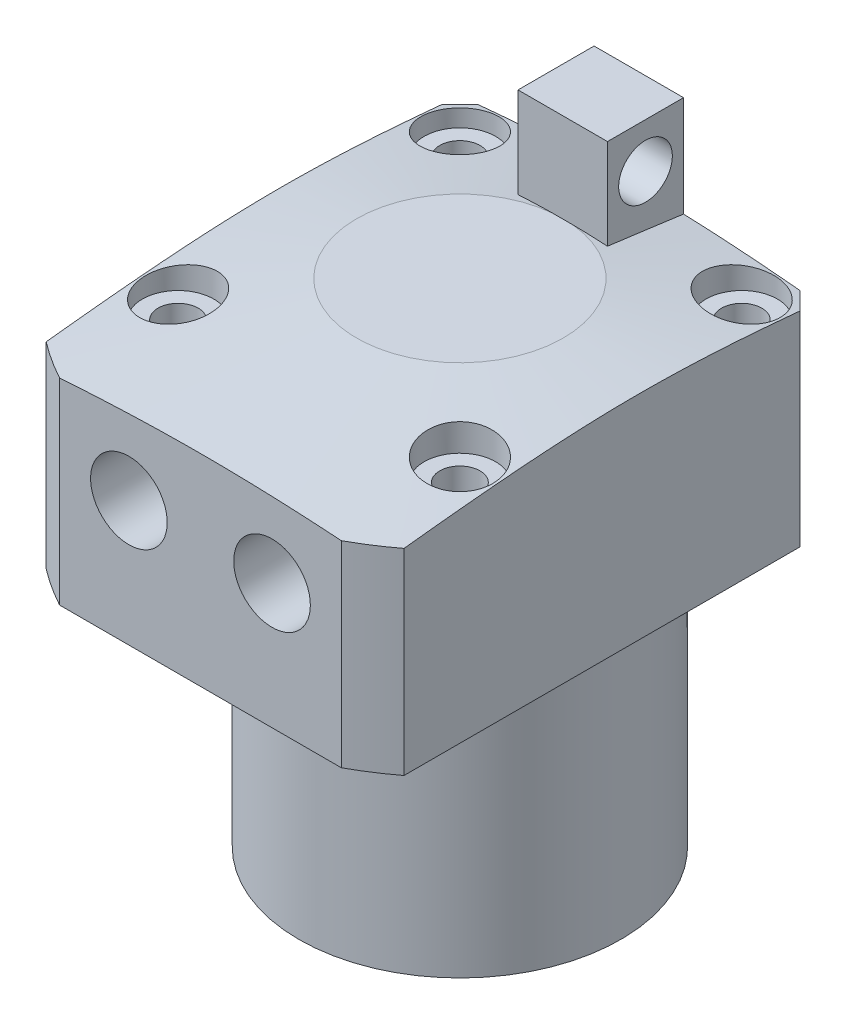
from build123d import *

# Parameters (mm, degrees)
SKETCH2_OUTSIDE_W                            = 89.668
SKETCH2_OUTSIDE_H                            = 89.668
SKETCH2_OUTSIDE_W_2                          = 40
SKETCH2_OUTSIDE_H_2                          = 49
CUT_EXTRUDE2_DEPTH                           = 73.131823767
CHAMFER1_SIZE                                = 2
G1_8_TAPPED_HOLE1_D                          = 8.566
G1_8_TAPPED_HOLE1_DEPTH                      = 22.18
CBORE_FOR_M4_HEX_SOCKET_HEAD_CAP_SCR_2_COUNT = 2
CBORE_FOR_M4_HEX_SOCKET_HEAD_CAP_SCR_2_PITCH = 31.5
CBORE_FOR_M4_HEX_SOCKET_HEAD_CAP_SCR_3_COUNT = 2
CBORE_FOR_M4_HEX_SOCKET_HEAD_CAP_SCR_3_PITCH = 44.547727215
CBORE_FOR_M4_HEX_SOCKET_HEAD_CAP_SCR_4_COUNT = 2
CBORE_FOR_M4_HEX_SOCKET_HEAD_CAP_SCR_4_PITCH = 31.5
F_8_0_8_DIAMETER_HOLE2_D                     = 8
F_8_0_8_DIAMETER_HOLE2_DEPTH                 = 1.5
SKETCH14_W                                   = 10
SKETCH14_H                                   = 8.5
BOSS_EXTRUDE1_DEPTH                          = 10
BOSS_EXTRUDE1_DIRECTION_2_REACH              = 67.315
F_6_0_6_DIAMETER_HOLE1_D                     = 6


with BuildPart() as part:
    # Sketch1 → Revolve1 (revolve)
    with BuildSketch(Plane.XY, mode=Mode.PRIVATE) as revolve1_sk:
        Polygon((0, 0), (-18, 0), (-18, 30), (-33, 30), (-33, 51.986092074), (-11.554930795, 55), (0, 55), align=None)
    revolve(revolve1_sk.sketch.rotate(Axis((0, 87.050829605, 0), (0, -1, 0)), 270), axis=Axis((0, 87.050829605, 0), (0, -1, 0)))

    # Sketch2 outside → Cut-Extrude2 (cut, through all)
    with BuildSketch(Plane(origin=(0, 55, 0), x_dir=(1, 0, 0), z_dir=(0, 1, 0))):
        Rectangle(SKETCH2_OUTSIDE_W, SKETCH2_OUTSIDE_H)
        with Locations((0, -4.5)):
            Rectangle(SKETCH2_OUTSIDE_W_2, SKETCH2_OUTSIDE_H_2, mode=Mode.SUBTRACT)
    extrude(amount=-CUT_EXTRUDE2_DEPTH, mode=Mode.SUBTRACT)

    # Chamfer1
    chamfer1_edges = [part.edges().sort_by_distance(p)[0] for p in [
        (20, 41.324422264, -20),
        (-20, 41.324422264, -20),
    ]]
    chamfer(chamfer1_edges, length=CHAMFER1_SIZE)

    # G1_8 Tapped Hole1
    with Locations(Plane.XY.offset(29)):
        with Locations((-8, 44), (8, 44)):
            Hole(G1_8_TAPPED_HOLE1_D / 2, depth=G1_8_TAPPED_HOLE1_DEPTH)

    # Sketch9 → CBORE for M4 Hex Socket Head Cap Screw2 (revolve, cut)
    with BuildSketch(Plane(origin=(15.75, 55, 15.75), x_dir=(0, 0, 1), z_dir=(1, 0, 0))):
        Polygon((0, 0), (0, 25), (2.275, 25), (2.25, 24.975), (2.25, 4), (4, 4), (4, 0), align=None)
    cbore_for_m4_hex_socket_head_cap_screw2 = revolve(axis=Axis((15.75, 61.35, 15.75), (0, -1, 0)), mode=Mode.SUBTRACT)

    # CBORE for M4 Hex Socket Head Cap Scr 2: CBORE for M4 Hex Socket Head Cap Screw2 ×2
    with Locations(*[(-i * CBORE_FOR_M4_HEX_SOCKET_HEAD_CAP_SCR_2_PITCH, 0, 0) for i in range(1, CBORE_FOR_M4_HEX_SOCKET_HEAD_CAP_SCR_2_COUNT)]):
        add(cbore_for_m4_hex_socket_head_cap_screw2, mode=Mode.SUBTRACT)

    # CBORE for M4 Hex Socket Head Cap Scr 3: CBORE for M4 Hex Socket Head Cap Screw2 ×2
    with Locations(*[Vector(-0.7071067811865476, 0, -0.7071067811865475) * (i * CBORE_FOR_M4_HEX_SOCKET_HEAD_CAP_SCR_3_PITCH) for i in range(1, CBORE_FOR_M4_HEX_SOCKET_HEAD_CAP_SCR_3_COUNT)]):
        add(cbore_for_m4_hex_socket_head_cap_screw2, mode=Mode.SUBTRACT)

    # CBORE for M4 Hex Socket Head Cap Scr 4: CBORE for M4 Hex Socket Head Cap Screw2 ×2
    with Locations(*[(0, 0, -i * CBORE_FOR_M4_HEX_SOCKET_HEAD_CAP_SCR_4_PITCH) for i in range(1, CBORE_FOR_M4_HEX_SOCKET_HEAD_CAP_SCR_4_COUNT)]):
        add(cbore_for_m4_hex_socket_head_cap_screw2, mode=Mode.SUBTRACT)

    # 8.0 _8_ Diameter Hole2
    with Locations(Plane.XZ.offset(-30)):
        with Locations((-8, 23.5), (8, 23.5)):
            Hole(F_8_0_8_DIAMETER_HOLE2_D / 2, depth=F_8_0_8_DIAMETER_HOLE2_DEPTH)

    # Sketch14 → Boss-Extrude1 (add)
    with BuildSketch(Plane(origin=(0, 55, 0), x_dir=(-1, 0, 0), z_dir=(0, 1, 0))):
        with Locations((0, -15.75)):
            Rectangle(SKETCH14_W, SKETCH14_H)
    extrude(amount=BOSS_EXTRUDE1_DEPTH)

    # Boss-Extrude1 direction 2: up to this cone (the profile starts outside it)
    boss_extrude1_direction_2_end = Plane(origin=(0, 55, 0), z_dir=(0, -1, 0)).offset(-1.623938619) * Cone(7.115e-06, 576.301333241, 80.993869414, align=(Align.CENTER, Align.CENTER, Align.MIN), mode=Mode.PRIVATE)
    # Sketch14 → Boss-Extrude1 direction 2 (add, up to the surface)
    with BuildSketch(Plane(origin=(0, 55, 0), x_dir=(-1, 0, 0), z_dir=(0, 1, 0)), mode=Mode.PRIVATE) as boss_extrude1_direction_2_sk1:
        with Locations((0, -15.75)):
            Rectangle(SKETCH14_W, SKETCH14_H)
    boss_extrude1_direction_2_tool1 = extrude(boss_extrude1_direction_2_sk1.sketch, amount=-BOSS_EXTRUDE1_DIRECTION_2_REACH, mode=Mode.PRIVATE) - boss_extrude1_direction_2_end
    add(boss_extrude1_direction_2_tool1.solids().sort_by_distance((0, 55, -15.75))[0])

    # 6.0 _6_ Diameter Hole1 (through all)
    with Locations(Plane(origin=(5, 0, 0), x_dir=(0, 0, -1), z_dir=(1, 0, 0))):
        with Locations((15.75, 60)):
            Hole(F_6_0_6_DIAMETER_HOLE1_D / 2)


solid = part.part
